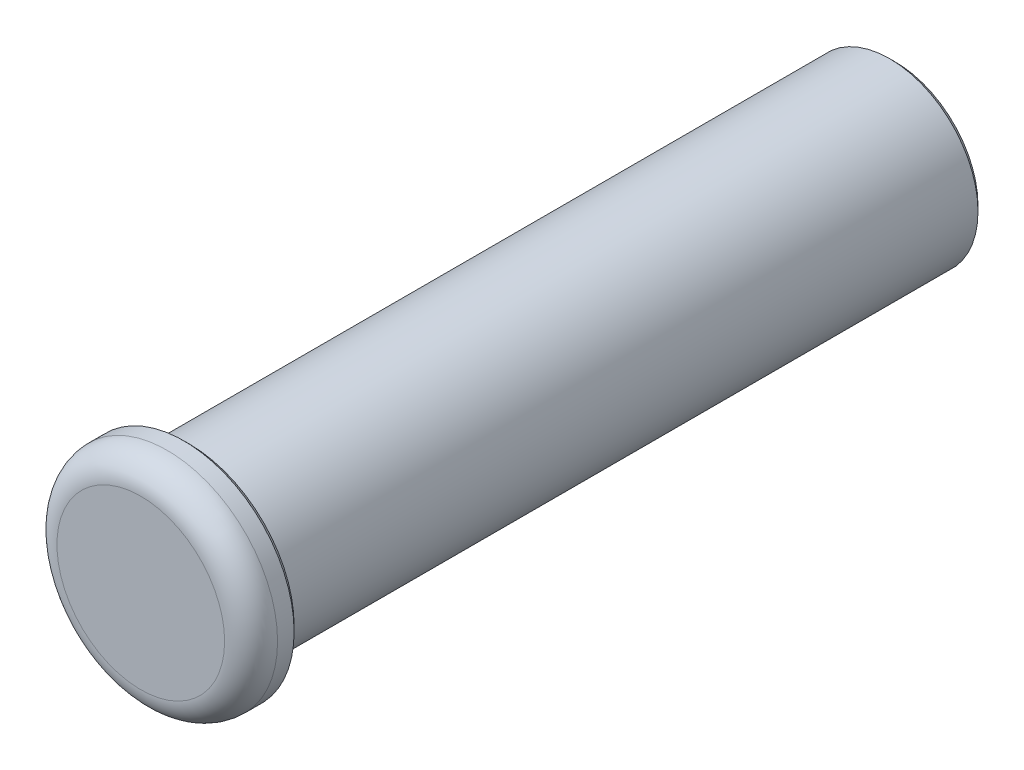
ISO-10303-21;
HEADER;
FILE_DESCRIPTION(('STEP AP214'),'2;1');
FILE_NAME('part.step','',(''),(''),'','','');
FILE_SCHEMA(('AUTOMOTIVE_DESIGN { 1 0 10303 214 1 1 1 1 }'));
ENDSEC;
DATA;
#1=APPLICATION_CONTEXT('core data for automotive mechanical design processes');
#2=APPLICATION_PROTOCOL_DEFINITION('international standard','automotive_design',2000,#1);
#3=PRODUCT_CONTEXT('',#1,'mechanical');
#4=PRODUCT('Part','Part','',(#3));
#5=PRODUCT_RELATED_PRODUCT_CATEGORY('part','',(#4));
#6=PRODUCT_DEFINITION_FORMATION('','',#4);
#7=PRODUCT_DEFINITION_CONTEXT('part definition',#1,'design');
#8=PRODUCT_DEFINITION('design','',#6,#7);
#9=PRODUCT_DEFINITION_SHAPE('','',#8);
#10=(LENGTH_UNIT() NAMED_UNIT(*) SI_UNIT(.MILLI.,.METRE.));
#11=(NAMED_UNIT(*) PLANE_ANGLE_UNIT() SI_UNIT($,.RADIAN.));
#12=(NAMED_UNIT(*) SI_UNIT($,.STERADIAN.) SOLID_ANGLE_UNIT());
#13=UNCERTAINTY_MEASURE_WITH_UNIT(LENGTH_MEASURE(1.E-05),#10,'distance_accuracy_value','');
#14=(GEOMETRIC_REPRESENTATION_CONTEXT(3) GLOBAL_UNCERTAINTY_ASSIGNED_CONTEXT((#13)) GLOBAL_UNIT_ASSIGNED_CONTEXT((#10,
#11,#12)) REPRESENTATION_CONTEXT('',''));
#15=CARTESIAN_POINT('',(0.,0.,0.));
#16=DIRECTION('',(0.,0.,1.));
#17=DIRECTION('',(1.,0.,0.));
#18=AXIS2_PLACEMENT_3D('',#15,#16,#17);
#19=CARTESIAN_POINT('',(0.,0.,0.));
#20=DIRECTION('',(0.,0.,1.));
#21=DIRECTION('',(1.,0.,0.));
#22=AXIS2_PLACEMENT_3D('',#19,#20,#21);
#23=PLANE('',#22);
#24=CARTESIAN_POINT('',(0.,0.,0.));
#25=DIRECTION('',(0.,0.,1.));
#26=DIRECTION('',(1.,0.,0.));
#27=AXIS2_PLACEMENT_3D('',#24,#25,#26);
#28=CIRCLE('',#27,3.75);
#29=CARTESIAN_POINT('',(3.75,0.,0.));
#30=VERTEX_POINT('',#29);
#31=EDGE_CURVE('E10',#30,#30,#28,.F.);
#32=ORIENTED_EDGE('',*,*,#31,.T.);
#33=EDGE_LOOP('',(#32));
#34=FACE_BOUND('',#33,.T.);
#35=ADVANCED_FACE('F29',(#34),#23,.F.);
#36=CARTESIAN_POINT('',(0.,0.,34.2));
#37=DIRECTION('',(0.,0.,1.));
#38=DIRECTION('',(1.,0.,0.));
#39=AXIS2_PLACEMENT_3D('',#36,#37,#38);
#40=CYLINDRICAL_SURFACE('',#39,4.);
#41=CARTESIAN_POINT('',(0.,0.,31.75));
#42=DIRECTION('',(0.,0.,1.));
#43=DIRECTION('',(1.,0.,0.));
#44=AXIS2_PLACEMENT_3D('',#41,#42,#43);
#45=CIRCLE('',#44,4.);
#46=CARTESIAN_POINT('',(4.,0.,31.75));
#47=VERTEX_POINT('',#46);
#48=EDGE_CURVE('E40',#47,#47,#45,.F.);
#49=ORIENTED_EDGE('',*,*,#48,.T.);
#50=EDGE_LOOP('',(#49));
#51=FACE_BOUND('',#50,.T.);
#52=CARTESIAN_POINT('',(0.,0.,0.25));
#53=DIRECTION('',(0.,0.,1.));
#54=DIRECTION('',(1.,0.,0.));
#55=AXIS2_PLACEMENT_3D('',#52,#53,#54);
#56=CIRCLE('',#55,4.);
#57=CARTESIAN_POINT('',(4.,0.,0.25));
#58=VERTEX_POINT('',#57);
#59=EDGE_CURVE('E44',#58,#58,#56,.T.);
#60=ORIENTED_EDGE('',*,*,#59,.T.);
#61=EDGE_LOOP('',(#60));
#62=FACE_BOUND('',#61,.T.);
#63=ADVANCED_FACE('F77',(#51,#62),#40,.T.);
#64=CARTESIAN_POINT('',(0.,4.,32.));
#65=DIRECTION('',(0.,0.,1.));
#66=DIRECTION('',(1.,0.,0.));
#67=AXIS2_PLACEMENT_3D('',#64,#65,#66);
#68=PLANE('',#67);
#69=CARTESIAN_POINT('',(0.,0.,32.));
#70=DIRECTION('',(0.,0.,1.));
#71=DIRECTION('',(1.,0.,0.));
#72=AXIS2_PLACEMENT_3D('',#69,#70,#71);
#73=CIRCLE('',#72,4.25);
#74=CARTESIAN_POINT('',(4.25,0.,32.));
#75=VERTEX_POINT('',#74);
#76=EDGE_CURVE('E49',#75,#75,#73,.T.);
#77=ORIENTED_EDGE('',*,*,#76,.T.);
#78=EDGE_LOOP('',(#77));
#79=FACE_BOUND('',#78,.T.);
#80=CARTESIAN_POINT('',(0.,0.,32.));
#81=DIRECTION('',(0.,0.,1.));
#82=DIRECTION('',(1.,0.,0.));
#83=AXIS2_PLACEMENT_3D('',#80,#81,#82);
#84=CIRCLE('',#83,4.74999999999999);
#85=CARTESIAN_POINT('',(4.74999999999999,0.,32.));
#86=VERTEX_POINT('',#85);
#87=EDGE_CURVE('E52',#86,#86,#84,.F.);
#88=ORIENTED_EDGE('',*,*,#87,.T.);
#89=EDGE_LOOP('',(#88));
#90=FACE_BOUND('',#89,.T.);
#91=ADVANCED_FACE('F72',(#79,#90),#68,.F.);
#92=CARTESIAN_POINT('',(0.,0.,34.2));
#93=DIRECTION('',(0.,0.,1.));
#94=DIRECTION('',(1.,0.,0.));
#95=AXIS2_PLACEMENT_3D('',#92,#93,#94);
#96=CYLINDRICAL_SURFACE('',#95,5.);
#97=CARTESIAN_POINT('',(0.,0.,32.25));
#98=DIRECTION('',(0.,0.,1.));
#99=DIRECTION('',(1.,0.,0.));
#100=AXIS2_PLACEMENT_3D('',#97,#98,#99);
#101=CIRCLE('',#100,5.);
#102=CARTESIAN_POINT('',(5.,0.,32.25));
#103=VERTEX_POINT('',#102);
#104=EDGE_CURVE('E36',#103,#103,#101,.T.);
#105=ORIENTED_EDGE('',*,*,#104,.T.);
#106=EDGE_LOOP('',(#105));
#107=FACE_BOUND('',#106,.T.);
#108=CARTESIAN_POINT('',(0.,0.,33.));
#109=DIRECTION('',(0.,0.,1.));
#110=DIRECTION('',(1.,0.,0.));
#111=AXIS2_PLACEMENT_3D('',#108,#109,#110);
#112=CIRCLE('',#111,5.);
#113=CARTESIAN_POINT('',(5.,0.,33.));
#114=VERTEX_POINT('',#113);
#115=EDGE_CURVE('E55',#114,#114,#112,.T.);
#116=ORIENTED_EDGE('',*,*,#115,.F.);
#117=EDGE_LOOP('',(#116));
#118=FACE_BOUND('',#117,.T.);
#119=ADVANCED_FACE('F67',(#107,#118),#96,.T.);
#120=CARTESIAN_POINT('',(0.,0.,33.));
#121=DIRECTION('',(0.,0.,1.));
#122=DIRECTION('',(1.,0.,0.));
#123=AXIS2_PLACEMENT_3D('',#120,#121,#122);
#124=TOROIDAL_SURFACE('',#123,3.8,1.2);
#125=CARTESIAN_POINT('',(0.,0.,34.2));
#126=DIRECTION('',(0.,0.,1.));
#127=DIRECTION('',(1.,0.,0.));
#128=AXIS2_PLACEMENT_3D('',#125,#126,#127);
#129=CIRCLE('',#128,3.8);
#130=CARTESIAN_POINT('',(3.8,0.,34.2));
#131=VERTEX_POINT('',#130);
#132=EDGE_CURVE('E58',#131,#131,#129,.T.);
#133=ORIENTED_EDGE('',*,*,#132,.F.);
#134=EDGE_LOOP('',(#133));
#135=FACE_BOUND('',#134,.T.);
#136=ORIENTED_EDGE('',*,*,#115,.T.);
#137=EDGE_LOOP('',(#136));
#138=FACE_BOUND('',#137,.T.);
#139=ADVANCED_FACE('F64',(#135,#138),#124,.T.);
#140=CARTESIAN_POINT('',(0.,3.8,34.2));
#141=DIRECTION('',(0.,0.,-1.));
#142=DIRECTION('',(-1.,0.,0.));
#143=AXIS2_PLACEMENT_3D('',#140,#141,#142);
#144=PLANE('',#143);
#145=ORIENTED_EDGE('',*,*,#132,.T.);
#146=EDGE_LOOP('',(#145));
#147=FACE_BOUND('',#146,.T.);
#148=ADVANCED_FACE('F62',(#147),#144,.F.);
#149=CARTESIAN_POINT('',(0.,0.,32.));
#150=DIRECTION('',(0.,0.,1.));
#151=DIRECTION('',(1.,0.,0.));
#152=AXIS2_PLACEMENT_3D('',#149,#150,#151);
#153=CONICAL_SURFACE('',#152,4.25,0.785398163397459);
#154=ORIENTED_EDGE('',*,*,#48,.F.);
#155=EDGE_LOOP('',(#154));
#156=FACE_BOUND('',#155,.T.);
#157=ORIENTED_EDGE('',*,*,#76,.F.);
#158=EDGE_LOOP('',(#157));
#159=FACE_BOUND('',#158,.T.);
#160=ADVANCED_FACE('F88',(#156,#159),#153,.T.);
#161=CARTESIAN_POINT('',(0.,0.,32.25));
#162=DIRECTION('',(0.,0.,1.));
#163=DIRECTION('',(1.,0.,0.));
#164=AXIS2_PLACEMENT_3D('',#161,#162,#163);
#165=CONICAL_SURFACE('',#164,5.,0.785398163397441);
#166=ORIENTED_EDGE('',*,*,#87,.F.);
#167=EDGE_LOOP('',(#166));
#168=FACE_BOUND('',#167,.T.);
#169=ORIENTED_EDGE('',*,*,#104,.F.);
#170=EDGE_LOOP('',(#169));
#171=FACE_BOUND('',#170,.T.);
#172=ADVANCED_FACE('F90',(#168,#171),#165,.T.);
#173=CARTESIAN_POINT('',(0.,0.,0.25));
#174=DIRECTION('',(0.,0.,1.));
#175=DIRECTION('',(1.,0.,0.));
#176=AXIS2_PLACEMENT_3D('',#173,#174,#175);
#177=CONICAL_SURFACE('',#176,4.,0.785398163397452);
#178=ORIENTED_EDGE('',*,*,#31,.F.);
#179=EDGE_LOOP('',(#178));
#180=FACE_BOUND('',#179,.T.);
#181=ORIENTED_EDGE('',*,*,#59,.F.);
#182=EDGE_LOOP('',(#181));
#183=FACE_BOUND('',#182,.T.);
#184=ADVANCED_FACE('F31',(#180,#183),#177,.T.);
#185=CLOSED_SHELL('',(#35,#63,#91,#119,#139,#148,#160,#172,#184));
#186=MANIFOLD_SOLID_BREP('B2',#185);
#187=ADVANCED_BREP_SHAPE_REPRESENTATION('',(#18,#186),#14);
#188=SHAPE_DEFINITION_REPRESENTATION(#9,#187);
ENDSEC;
END-ISO-10303-21;
